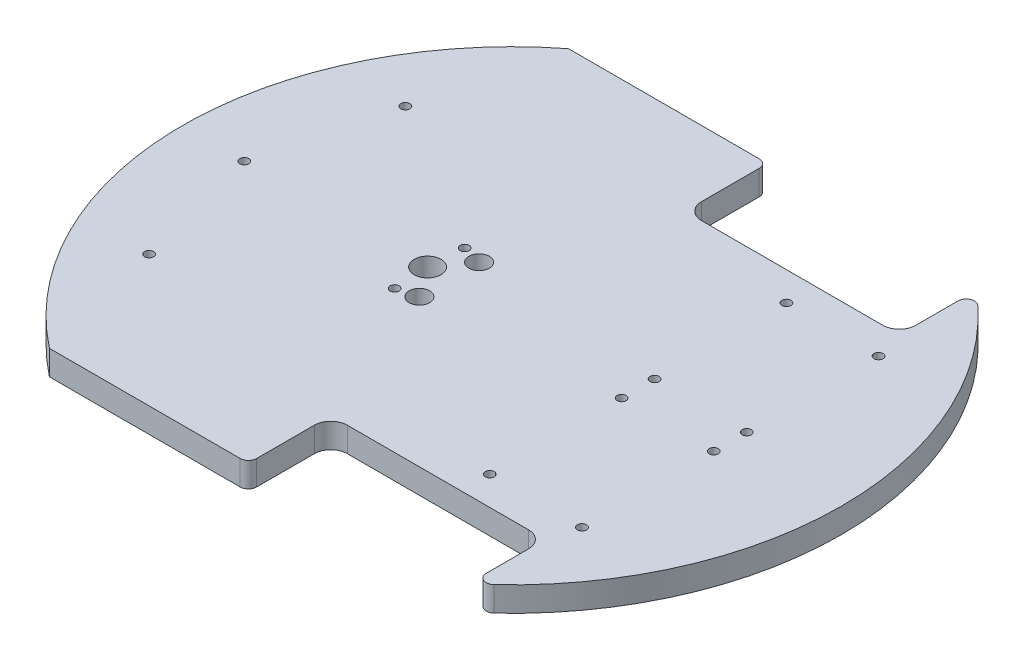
ISO-10303-21;
HEADER;
FILE_DESCRIPTION(('STEP AP214'),'2;1');
FILE_NAME('part.step','',(''),(''),'','','');
FILE_SCHEMA(('AUTOMOTIVE_DESIGN { 1 0 10303 214 1 1 1 1 }'));
ENDSEC;
DATA;
#1=APPLICATION_CONTEXT('core data for automotive mechanical design processes');
#2=APPLICATION_PROTOCOL_DEFINITION('international standard','automotive_design',2000,#1);
#3=PRODUCT_CONTEXT('',#1,'mechanical');
#4=PRODUCT('Part','Part','',(#3));
#5=PRODUCT_RELATED_PRODUCT_CATEGORY('part','',(#4));
#6=PRODUCT_DEFINITION_FORMATION('','',#4);
#7=PRODUCT_DEFINITION_CONTEXT('part definition',#1,'design');
#8=PRODUCT_DEFINITION('design','',#6,#7);
#9=PRODUCT_DEFINITION_SHAPE('','',#8);
#10=(LENGTH_UNIT() NAMED_UNIT(*) SI_UNIT(.MILLI.,.METRE.));
#11=(NAMED_UNIT(*) PLANE_ANGLE_UNIT() SI_UNIT($,.RADIAN.));
#12=(NAMED_UNIT(*) SI_UNIT($,.STERADIAN.) SOLID_ANGLE_UNIT());
#13=UNCERTAINTY_MEASURE_WITH_UNIT(LENGTH_MEASURE(1.E-05),#10,'distance_accuracy_value','');
#14=(GEOMETRIC_REPRESENTATION_CONTEXT(3) GLOBAL_UNCERTAINTY_ASSIGNED_CONTEXT((#13)) GLOBAL_UNIT_ASSIGNED_CONTEXT((#10,
#11,#12)) REPRESENTATION_CONTEXT('',''));
#15=CARTESIAN_POINT('',(0.,0.,0.));
#16=DIRECTION('',(0.,0.,1.));
#17=DIRECTION('',(1.,0.,0.));
#18=AXIS2_PLACEMENT_3D('',#15,#16,#17);
#19=CARTESIAN_POINT('',(-15.,6.,0.));
#20=DIRECTION('',(0.,1.,0.));
#21=DIRECTION('',(0.,0.,1.));
#22=AXIS2_PLACEMENT_3D('',#19,#20,#21);
#23=PLANE('',#22);
#24=CARTESIAN_POINT('',(-35.5,6.,0.));
#25=DIRECTION('',(0.,1.,0.));
#26=DIRECTION('',(0.,0.,1.));
#27=AXIS2_PLACEMENT_3D('',#24,#25,#26);
#28=CIRCLE('',#27,3.25);
#29=CARTESIAN_POINT('',(-35.5,6.,3.25));
#30=VERTEX_POINT('',#29);
#31=EDGE_CURVE('E465',#30,#30,#28,.T.);
#32=ORIENTED_EDGE('',*,*,#31,.F.);
#33=EDGE_LOOP('',(#32));
#34=FACE_BOUND('',#33,.T.);
#35=CARTESIAN_POINT('',(-72.,6.,-31.1));
#36=DIRECTION('',(0.,1.,0.));
#37=DIRECTION('',(0.,0.,1.));
#38=AXIS2_PLACEMENT_3D('',#35,#36,#37);
#39=CIRCLE('',#38,1.10000000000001);
#40=CARTESIAN_POINT('',(-72.,6.,-30.));
#41=VERTEX_POINT('',#40);
#42=EDGE_CURVE('E477',#41,#41,#39,.T.);
#43=ORIENTED_EDGE('',*,*,#42,.F.);
#44=EDGE_LOOP('',(#43));
#45=FACE_BOUND('',#44,.T.);
#46=CARTESIAN_POINT('',(-72.,6.,31.1));
#47=DIRECTION('',(0.,1.,0.));
#48=DIRECTION('',(0.,0.,-1.));
#49=AXIS2_PLACEMENT_3D('',#46,#47,#48);
#50=CIRCLE('',#49,1.10000000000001);
#51=CARTESIAN_POINT('',(-72.,6.,30.));
#52=VERTEX_POINT('',#51);
#53=EDGE_CURVE('E489',#52,#52,#50,.T.);
#54=ORIENTED_EDGE('',*,*,#53,.F.);
#55=EDGE_LOOP('',(#54));
#56=FACE_BOUND('',#55,.T.);
#57=CARTESIAN_POINT('',(-35.,6.,8.5));
#58=DIRECTION('',(0.,1.,0.));
#59=DIRECTION('',(0.,0.,-1.));
#60=AXIS2_PLACEMENT_3D('',#57,#58,#59);
#61=CIRCLE('',#60,1.1);
#62=CARTESIAN_POINT('',(-35.,6.,7.4));
#63=VERTEX_POINT('',#62);
#64=EDGE_CURVE('E501',#63,#63,#61,.T.);
#65=ORIENTED_EDGE('',*,*,#64,.F.);
#66=EDGE_LOOP('',(#65));
#67=FACE_BOUND('',#66,.T.);
#68=CARTESIAN_POINT('',(15.6,6.,-36.));
#69=DIRECTION('',(0.,1.,0.));
#70=DIRECTION('',(0.,0.,1.));
#71=AXIS2_PLACEMENT_3D('',#68,#69,#70);
#72=CIRCLE('',#71,1.09999999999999);
#73=CARTESIAN_POINT('',(15.6,6.,-34.9));
#74=VERTEX_POINT('',#73);
#75=EDGE_CURVE('E513',#74,#74,#72,.T.);
#76=ORIENTED_EDGE('',*,*,#75,.F.);
#77=EDGE_LOOP('',(#76));
#78=FACE_BOUND('',#77,.T.);
#79=CARTESIAN_POINT('',(15.6,6.,36.));
#80=DIRECTION('',(0.,1.,0.));
#81=DIRECTION('',(0.,0.,-1.));
#82=AXIS2_PLACEMENT_3D('',#79,#80,#81);
#83=CIRCLE('',#82,1.09999999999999);
#84=CARTESIAN_POINT('',(15.6,6.,34.9));
#85=VERTEX_POINT('',#84);
#86=EDGE_CURVE('E525',#85,#85,#83,.T.);
#87=ORIENTED_EDGE('',*,*,#86,.F.);
#88=EDGE_LOOP('',(#87));
#89=FACE_BOUND('',#88,.T.);
#90=CARTESIAN_POINT('',(37.9590359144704,6.,4.));
#91=DIRECTION('',(0.,1.,0.));
#92=DIRECTION('',(0.,0.,1.));
#93=AXIS2_PLACEMENT_3D('',#90,#91,#92);
#94=CIRCLE('',#93,1.1);
#95=CARTESIAN_POINT('',(37.9590359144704,6.,5.1));
#96=VERTEX_POINT('',#95);
#97=EDGE_CURVE('E537',#96,#96,#94,.T.);
#98=ORIENTED_EDGE('',*,*,#97,.F.);
#99=EDGE_LOOP('',(#98));
#100=FACE_BOUND('',#99,.T.);
#101=CARTESIAN_POINT('',(37.9590359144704,6.,-4.));
#102=DIRECTION('',(0.,1.,0.));
#103=DIRECTION('',(0.,0.,-1.));
#104=AXIS2_PLACEMENT_3D('',#101,#102,#103);
#105=CIRCLE('',#104,1.1);
#106=CARTESIAN_POINT('',(37.9590359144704,6.,-5.1));
#107=VERTEX_POINT('',#106);
#108=EDGE_CURVE('E179',#107,#107,#105,.T.);
#109=ORIENTED_EDGE('',*,*,#108,.F.);
#110=EDGE_LOOP('',(#109));
#111=FACE_BOUND('',#110,.T.);
#112=CARTESIAN_POINT('',(-15.,6.,0.));
#113=DIRECTION('',(0.,1.,0.));
#114=DIRECTION('',(0.,0.,1.));
#115=AXIS2_PLACEMENT_3D('',#112,#113,#114);
#116=CIRCLE('',#115,80.0000000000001);
#117=CARTESIAN_POINT('',(-64.3051721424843,6.,-63.0000000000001));
#118=VERTEX_POINT('',#117);
#119=CARTESIAN_POINT('',(-64.3051721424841,6.,63.));
#120=VERTEX_POINT('',#119);
#121=EDGE_CURVE('E217',#118,#120,#116,.T.);
#122=ORIENTED_EDGE('',*,*,#121,.T.);
#123=DIRECTION('',(1.,0.,0.));
#124=VECTOR('',#123,1.);
#125=CARTESIAN_POINT('',(-64.3051721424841,6.,63.));
#126=LINE('',#125,#124);
#127=CARTESIAN_POINT('',(-18.,6.,63.));
#128=VERTEX_POINT('',#127);
#129=EDGE_CURVE('E174',#120,#128,#126,.T.);
#130=ORIENTED_EDGE('',*,*,#129,.T.);
#131=CARTESIAN_POINT('',(-18.,6.,61.));
#132=DIRECTION('',(0.,1.,0.));
#133=DIRECTION('',(0.,0.,1.));
#134=AXIS2_PLACEMENT_3D('',#131,#132,#133);
#135=CIRCLE('',#134,2.00000000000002);
#136=CARTESIAN_POINT('',(-16.,6.,61.));
#137=VERTEX_POINT('',#136);
#138=EDGE_CURVE('E220',#128,#137,#135,.T.);
#139=ORIENTED_EDGE('',*,*,#138,.T.);
#140=DIRECTION('',(0.,0.,-1.));
#141=VECTOR('',#140,1.);
#142=CARTESIAN_POINT('',(-16.,6.,61.));
#143=LINE('',#142,#141);
#144=CARTESIAN_POINT('',(-16.,6.,47.));
#145=VERTEX_POINT('',#144);
#146=EDGE_CURVE('E222',#137,#145,#143,.T.);
#147=ORIENTED_EDGE('',*,*,#146,.T.);
#148=CARTESIAN_POINT('',(-12.,6.,47.));
#149=DIRECTION('',(0.,-1.,0.));
#150=DIRECTION('',(0.,0.,-1.));
#151=AXIS2_PLACEMENT_3D('',#148,#149,#150);
#152=CIRCLE('',#151,3.99999999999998);
#153=CARTESIAN_POINT('',(-12.,6.,43.));
#154=VERTEX_POINT('',#153);
#155=EDGE_CURVE('E224',#145,#154,#152,.T.);
#156=ORIENTED_EDGE('',*,*,#155,.T.);
#157=DIRECTION('',(1.,0.,0.));
#158=VECTOR('',#157,1.);
#159=CARTESIAN_POINT('',(-12.,6.,43.));
#160=LINE('',#159,#158);
#161=CARTESIAN_POINT('',(32.,6.,43.));
#162=VERTEX_POINT('',#161);
#163=EDGE_CURVE('E226',#154,#162,#160,.T.);
#164=ORIENTED_EDGE('',*,*,#163,.T.);
#165=CARTESIAN_POINT('',(32.,6.,47.));
#166=DIRECTION('',(0.,-1.,0.));
#167=DIRECTION('',(0.,0.,-1.));
#168=AXIS2_PLACEMENT_3D('',#165,#166,#167);
#169=CIRCLE('',#168,4.00000000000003);
#170=CARTESIAN_POINT('',(36.,6.,47.));
#171=VERTEX_POINT('',#170);
#172=EDGE_CURVE('E228',#162,#171,#169,.T.);
#173=ORIENTED_EDGE('',*,*,#172,.T.);
#174=DIRECTION('',(0.,0.,1.));
#175=VECTOR('',#174,1.);
#176=CARTESIAN_POINT('',(36.,6.,57.227615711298));
#177=LINE('',#176,#175);
#178=CARTESIAN_POINT('',(36.,6.,57.227615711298));
#179=VERTEX_POINT('',#178);
#180=EDGE_CURVE('E230',#171,#179,#177,.T.);
#181=ORIENTED_EDGE('',*,*,#180,.T.);
#182=CARTESIAN_POINT('',(38.,6.,57.227615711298));
#183=DIRECTION('',(0.,1.,0.));
#184=DIRECTION('',(0.,0.,1.));
#185=AXIS2_PLACEMENT_3D('',#182,#183,#184);
#186=CIRCLE('',#185,1.99999999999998);
#187=CARTESIAN_POINT('',(39.3589743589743,6.,58.6949904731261));
#188=VERTEX_POINT('',#187);
#189=EDGE_CURVE('E232',#179,#188,#186,.T.);
#190=ORIENTED_EDGE('',*,*,#189,.T.);
#191=CARTESIAN_POINT('',(-15.,6.,0.));
#192=DIRECTION('',(0.,1.,0.));
#193=DIRECTION('',(0.,0.,1.));
#194=AXIS2_PLACEMENT_3D('',#191,#192,#193);
#195=CIRCLE('',#194,80.);
#196=CARTESIAN_POINT('',(39.3589743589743,6.,-58.6949904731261));
#197=VERTEX_POINT('',#196);
#198=EDGE_CURVE('E234',#188,#197,#195,.T.);
#199=ORIENTED_EDGE('',*,*,#198,.T.);
#200=CARTESIAN_POINT('',(38.,6.,-57.227615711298));
#201=DIRECTION('',(0.,1.,0.));
#202=DIRECTION('',(0.,0.,1.));
#203=AXIS2_PLACEMENT_3D('',#200,#201,#202);
#204=CIRCLE('',#203,1.99999999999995);
#205=CARTESIAN_POINT('',(36.,6.,-57.2276157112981));
#206=VERTEX_POINT('',#205);
#207=EDGE_CURVE('E236',#197,#206,#204,.T.);
#208=ORIENTED_EDGE('',*,*,#207,.T.);
#209=DIRECTION('',(0.,0.,1.));
#210=VECTOR('',#209,1.);
#211=CARTESIAN_POINT('',(36.0000000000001,6.,-57.2276157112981));
#212=LINE('',#211,#210);
#213=CARTESIAN_POINT('',(36.0000000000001,6.,-47.));
#214=VERTEX_POINT('',#213);
#215=EDGE_CURVE('E238',#206,#214,#212,.T.);
#216=ORIENTED_EDGE('',*,*,#215,.T.);
#217=CARTESIAN_POINT('',(32.,6.,-47.));
#218=DIRECTION('',(0.,-1.,0.));
#219=DIRECTION('',(0.,0.,-1.));
#220=AXIS2_PLACEMENT_3D('',#217,#218,#219);
#221=CIRCLE('',#220,4.00000000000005);
#222=CARTESIAN_POINT('',(32.0000000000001,6.,-43.));
#223=VERTEX_POINT('',#222);
#224=EDGE_CURVE('E240',#214,#223,#221,.T.);
#225=ORIENTED_EDGE('',*,*,#224,.T.);
#226=DIRECTION('',(-1.,0.,0.));
#227=VECTOR('',#226,1.);
#228=CARTESIAN_POINT('',(-12.,6.,-43.));
#229=LINE('',#228,#227);
#230=CARTESIAN_POINT('',(-12.,6.,-43.));
#231=VERTEX_POINT('',#230);
#232=EDGE_CURVE('E242',#223,#231,#229,.T.);
#233=ORIENTED_EDGE('',*,*,#232,.T.);
#234=CARTESIAN_POINT('',(-12.,6.,-47.));
#235=DIRECTION('',(0.,-1.,0.));
#236=DIRECTION('',(0.,0.,-1.));
#237=AXIS2_PLACEMENT_3D('',#234,#235,#236);
#238=CIRCLE('',#237,4.);
#239=CARTESIAN_POINT('',(-16.,6.,-47.));
#240=VERTEX_POINT('',#239);
#241=EDGE_CURVE('E244',#231,#240,#238,.T.);
#242=ORIENTED_EDGE('',*,*,#241,.T.);
#243=DIRECTION('',(0.,0.,-1.));
#244=VECTOR('',#243,1.);
#245=CARTESIAN_POINT('',(-16.,6.,-61.));
#246=LINE('',#245,#244);
#247=CARTESIAN_POINT('',(-16.,6.,-61.));
#248=VERTEX_POINT('',#247);
#249=EDGE_CURVE('E246',#240,#248,#246,.T.);
#250=ORIENTED_EDGE('',*,*,#249,.T.);
#251=CARTESIAN_POINT('',(-18.,6.,-61.));
#252=DIRECTION('',(0.,1.,0.));
#253=DIRECTION('',(0.,0.,1.));
#254=AXIS2_PLACEMENT_3D('',#251,#252,#253);
#255=CIRCLE('',#254,2.00000000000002);
#256=CARTESIAN_POINT('',(-18.,6.,-63.));
#257=VERTEX_POINT('',#256);
#258=EDGE_CURVE('E55',#248,#257,#255,.T.);
#259=ORIENTED_EDGE('',*,*,#258,.T.);
#260=DIRECTION('',(-1.,0.,0.));
#261=VECTOR('',#260,1.);
#262=CARTESIAN_POINT('',(-64.3051721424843,6.,-63.0000000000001));
#263=LINE('',#262,#261);
#264=EDGE_CURVE('E50',#257,#118,#263,.T.);
#265=ORIENTED_EDGE('',*,*,#264,.T.);
#266=EDGE_LOOP('',(#122,#130,#139,#147,#156,#164,#173,#181,#190,#199,#208,#216,#225,#233,#242,
#250,#259,#265));
#267=FACE_BOUND('',#266,.T.);
#268=CARTESIAN_POINT('',(15.6,6.,4.));
#269=DIRECTION('',(0.,1.,0.));
#270=DIRECTION('',(0.,0.,1.));
#271=AXIS2_PLACEMENT_3D('',#268,#269,#270);
#272=CIRCLE('',#271,1.1);
#273=CARTESIAN_POINT('',(15.6,6.,5.1));
#274=VERTEX_POINT('',#273);
#275=EDGE_CURVE('E543',#274,#274,#272,.T.);
#276=ORIENTED_EDGE('',*,*,#275,.F.);
#277=EDGE_LOOP('',(#276));
#278=FACE_BOUND('',#277,.T.);
#279=CARTESIAN_POINT('',(37.9590359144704,6.,36.));
#280=DIRECTION('',(0.,1.,0.));
#281=DIRECTION('',(0.,0.,-1.));
#282=AXIS2_PLACEMENT_3D('',#279,#280,#281);
#283=CIRCLE('',#282,1.1);
#284=CARTESIAN_POINT('',(37.9590359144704,6.,34.9));
#285=VERTEX_POINT('',#284);
#286=EDGE_CURVE('E531',#285,#285,#283,.T.);
#287=ORIENTED_EDGE('',*,*,#286,.F.);
#288=EDGE_LOOP('',(#287));
#289=FACE_BOUND('',#288,.T.);
#290=CARTESIAN_POINT('',(37.9590359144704,6.,-36.));
#291=DIRECTION('',(0.,1.,0.));
#292=DIRECTION('',(0.,0.,1.));
#293=AXIS2_PLACEMENT_3D('',#290,#291,#292);
#294=CIRCLE('',#293,1.1);
#295=CARTESIAN_POINT('',(37.9590359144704,6.,-34.9));
#296=VERTEX_POINT('',#295);
#297=EDGE_CURVE('E519',#296,#296,#294,.T.);
#298=ORIENTED_EDGE('',*,*,#297,.F.);
#299=EDGE_LOOP('',(#298));
#300=FACE_BOUND('',#299,.T.);
#301=CARTESIAN_POINT('',(15.6,6.,-4.));
#302=DIRECTION('',(0.,1.,0.));
#303=DIRECTION('',(0.,0.,-1.));
#304=AXIS2_PLACEMENT_3D('',#301,#302,#303);
#305=CIRCLE('',#304,1.1);
#306=CARTESIAN_POINT('',(15.6,6.,-5.1));
#307=VERTEX_POINT('',#306);
#308=EDGE_CURVE('E507',#307,#307,#305,.T.);
#309=ORIENTED_EDGE('',*,*,#308,.F.);
#310=EDGE_LOOP('',(#309));
#311=FACE_BOUND('',#310,.T.);
#312=CARTESIAN_POINT('',(-30.25,6.,-7.25));
#313=DIRECTION('',(0.,1.,0.));
#314=DIRECTION('',(0.,0.,-1.));
#315=AXIS2_PLACEMENT_3D('',#312,#313,#314);
#316=CIRCLE('',#315,2.5);
#317=CARTESIAN_POINT('',(-30.25,6.,-9.75));
#318=VERTEX_POINT('',#317);
#319=EDGE_CURVE('E495',#318,#318,#316,.T.);
#320=ORIENTED_EDGE('',*,*,#319,.F.);
#321=EDGE_LOOP('',(#320));
#322=FACE_BOUND('',#321,.T.);
#323=CARTESIAN_POINT('',(-80.,6.,0.));
#324=DIRECTION('',(0.,1.,0.));
#325=DIRECTION('',(0.,0.,1.));
#326=AXIS2_PLACEMENT_3D('',#323,#324,#325);
#327=CIRCLE('',#326,1.10000000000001);
#328=CARTESIAN_POINT('',(-80.,6.,1.10000000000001));
#329=VERTEX_POINT('',#328);
#330=EDGE_CURVE('E483',#329,#329,#327,.T.);
#331=ORIENTED_EDGE('',*,*,#330,.F.);
#332=EDGE_LOOP('',(#331));
#333=FACE_BOUND('',#332,.T.);
#334=CARTESIAN_POINT('',(-35.,6.,-8.5));
#335=DIRECTION('',(0.,1.,0.));
#336=DIRECTION('',(0.,0.,1.));
#337=AXIS2_PLACEMENT_3D('',#334,#335,#336);
#338=CIRCLE('',#337,1.1);
#339=CARTESIAN_POINT('',(-35.,6.,-7.4));
#340=VERTEX_POINT('',#339);
#341=EDGE_CURVE('E471',#340,#340,#338,.T.);
#342=ORIENTED_EDGE('',*,*,#341,.F.);
#343=EDGE_LOOP('',(#342));
#344=FACE_BOUND('',#343,.T.);
#345=CARTESIAN_POINT('',(-30.25,6.,7.25));
#346=DIRECTION('',(0.,1.,0.));
#347=DIRECTION('',(0.,0.,1.));
#348=AXIS2_PLACEMENT_3D('',#345,#346,#347);
#349=CIRCLE('',#348,2.5);
#350=CARTESIAN_POINT('',(-30.25,6.,9.75));
#351=VERTEX_POINT('',#350);
#352=EDGE_CURVE('E454',#351,#351,#349,.T.);
#353=ORIENTED_EDGE('',*,*,#352,.F.);
#354=EDGE_LOOP('',(#353));
#355=FACE_BOUND('',#354,.T.);
#356=ADVANCED_FACE('F35',(#34,#45,#56,#67,#78,#89,#100,#111,#267,#278,#289,#300,#311,#322,#333,
#344,#355),#23,.T.);
#357=CARTESIAN_POINT('',(-15.,0.,0.));
#358=DIRECTION('',(0.,1.,0.));
#359=DIRECTION('',(0.,0.,1.));
#360=AXIS2_PLACEMENT_3D('',#357,#358,#359);
#361=PLANE('',#360);
#362=CARTESIAN_POINT('',(-35.5,0.,0.));
#363=DIRECTION('',(0.,1.,0.));
#364=DIRECTION('',(0.,0.,1.));
#365=AXIS2_PLACEMENT_3D('',#362,#363,#364);
#366=CIRCLE('',#365,3.25);
#367=CARTESIAN_POINT('',(-35.5,0.,3.25));
#368=VERTEX_POINT('',#367);
#369=EDGE_CURVE('E460',#368,#368,#366,.T.);
#370=ORIENTED_EDGE('',*,*,#369,.T.);
#371=EDGE_LOOP('',(#370));
#372=FACE_BOUND('',#371,.T.);
#373=CARTESIAN_POINT('',(-72.,0.,-31.1));
#374=DIRECTION('',(0.,1.,0.));
#375=DIRECTION('',(0.,0.,1.));
#376=AXIS2_PLACEMENT_3D('',#373,#374,#375);
#377=CIRCLE('',#376,1.10000000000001);
#378=CARTESIAN_POINT('',(-72.,0.,-30.));
#379=VERTEX_POINT('',#378);
#380=EDGE_CURVE('E474',#379,#379,#377,.T.);
#381=ORIENTED_EDGE('',*,*,#380,.T.);
#382=EDGE_LOOP('',(#381));
#383=FACE_BOUND('',#382,.T.);
#384=CARTESIAN_POINT('',(-72.,0.,31.1));
#385=DIRECTION('',(0.,1.,0.));
#386=DIRECTION('',(0.,0.,-1.));
#387=AXIS2_PLACEMENT_3D('',#384,#385,#386);
#388=CIRCLE('',#387,1.10000000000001);
#389=CARTESIAN_POINT('',(-72.,0.,30.));
#390=VERTEX_POINT('',#389);
#391=EDGE_CURVE('E486',#390,#390,#388,.T.);
#392=ORIENTED_EDGE('',*,*,#391,.T.);
#393=EDGE_LOOP('',(#392));
#394=FACE_BOUND('',#393,.T.);
#395=CARTESIAN_POINT('',(-35.,0.,8.5));
#396=DIRECTION('',(0.,1.,0.));
#397=DIRECTION('',(0.,0.,-1.));
#398=AXIS2_PLACEMENT_3D('',#395,#396,#397);
#399=CIRCLE('',#398,1.1);
#400=CARTESIAN_POINT('',(-35.,0.,7.4));
#401=VERTEX_POINT('',#400);
#402=EDGE_CURVE('E498',#401,#401,#399,.T.);
#403=ORIENTED_EDGE('',*,*,#402,.T.);
#404=EDGE_LOOP('',(#403));
#405=FACE_BOUND('',#404,.T.);
#406=CARTESIAN_POINT('',(15.6,0.,-36.));
#407=DIRECTION('',(0.,1.,0.));
#408=DIRECTION('',(0.,0.,1.));
#409=AXIS2_PLACEMENT_3D('',#406,#407,#408);
#410=CIRCLE('',#409,1.09999999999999);
#411=CARTESIAN_POINT('',(15.6,0.,-34.9));
#412=VERTEX_POINT('',#411);
#413=EDGE_CURVE('E510',#412,#412,#410,.T.);
#414=ORIENTED_EDGE('',*,*,#413,.T.);
#415=EDGE_LOOP('',(#414));
#416=FACE_BOUND('',#415,.T.);
#417=CARTESIAN_POINT('',(15.6,0.,36.));
#418=DIRECTION('',(0.,1.,0.));
#419=DIRECTION('',(0.,0.,-1.));
#420=AXIS2_PLACEMENT_3D('',#417,#418,#419);
#421=CIRCLE('',#420,1.09999999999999);
#422=CARTESIAN_POINT('',(15.6,0.,34.9));
#423=VERTEX_POINT('',#422);
#424=EDGE_CURVE('E522',#423,#423,#421,.T.);
#425=ORIENTED_EDGE('',*,*,#424,.T.);
#426=EDGE_LOOP('',(#425));
#427=FACE_BOUND('',#426,.T.);
#428=CARTESIAN_POINT('',(37.9590359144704,0.,4.));
#429=DIRECTION('',(0.,1.,0.));
#430=DIRECTION('',(0.,0.,1.));
#431=AXIS2_PLACEMENT_3D('',#428,#429,#430);
#432=CIRCLE('',#431,1.1);
#433=CARTESIAN_POINT('',(37.9590359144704,0.,5.1));
#434=VERTEX_POINT('',#433);
#435=EDGE_CURVE('E534',#434,#434,#432,.T.);
#436=ORIENTED_EDGE('',*,*,#435,.T.);
#437=EDGE_LOOP('',(#436));
#438=FACE_BOUND('',#437,.T.);
#439=CARTESIAN_POINT('',(37.9590359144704,0.,-4.));
#440=DIRECTION('',(0.,1.,0.));
#441=DIRECTION('',(0.,0.,-1.));
#442=AXIS2_PLACEMENT_3D('',#439,#440,#441);
#443=CIRCLE('',#442,1.1);
#444=CARTESIAN_POINT('',(37.9590359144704,0.,-5.1));
#445=VERTEX_POINT('',#444);
#446=EDGE_CURVE('E182',#445,#445,#443,.T.);
#447=ORIENTED_EDGE('',*,*,#446,.T.);
#448=EDGE_LOOP('',(#447));
#449=FACE_BOUND('',#448,.T.);
#450=CARTESIAN_POINT('',(-15.,0.,0.));
#451=DIRECTION('',(0.,1.,0.));
#452=DIRECTION('',(0.,0.,1.));
#453=AXIS2_PLACEMENT_3D('',#450,#451,#452);
#454=CIRCLE('',#453,80.0000000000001);
#455=CARTESIAN_POINT('',(-64.3051721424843,0.,-63.0000000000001));
#456=VERTEX_POINT('',#455);
#457=CARTESIAN_POINT('',(-64.3051721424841,0.,63.));
#458=VERTEX_POINT('',#457);
#459=EDGE_CURVE('E165',#456,#458,#454,.T.);
#460=ORIENTED_EDGE('',*,*,#459,.F.);
#461=DIRECTION('',(-1.,0.,0.));
#462=VECTOR('',#461,1.);
#463=CARTESIAN_POINT('',(-64.3051721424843,0.,-63.0000000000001));
#464=LINE('',#463,#462);
#465=CARTESIAN_POINT('',(-18.,0.,-63.));
#466=VERTEX_POINT('',#465);
#467=EDGE_CURVE('E215',#466,#456,#464,.T.);
#468=ORIENTED_EDGE('',*,*,#467,.F.);
#469=CARTESIAN_POINT('',(-18.,0.,-61.));
#470=DIRECTION('',(0.,1.,0.));
#471=DIRECTION('',(0.,0.,1.));
#472=AXIS2_PLACEMENT_3D('',#469,#470,#471);
#473=CIRCLE('',#472,2.00000000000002);
#474=CARTESIAN_POINT('',(-16.,0.,-61.));
#475=VERTEX_POINT('',#474);
#476=EDGE_CURVE('E213',#475,#466,#473,.T.);
#477=ORIENTED_EDGE('',*,*,#476,.F.);
#478=DIRECTION('',(0.,0.,-1.));
#479=VECTOR('',#478,1.);
#480=CARTESIAN_POINT('',(-16.,0.,-61.));
#481=LINE('',#480,#479);
#482=CARTESIAN_POINT('',(-16.,0.,-47.));
#483=VERTEX_POINT('',#482);
#484=EDGE_CURVE('E211',#483,#475,#481,.T.);
#485=ORIENTED_EDGE('',*,*,#484,.F.);
#486=CARTESIAN_POINT('',(-12.,0.,-47.));
#487=DIRECTION('',(0.,-1.,0.));
#488=DIRECTION('',(0.,0.,-1.));
#489=AXIS2_PLACEMENT_3D('',#486,#487,#488);
#490=CIRCLE('',#489,4.);
#491=CARTESIAN_POINT('',(-12.,0.,-43.));
#492=VERTEX_POINT('',#491);
#493=EDGE_CURVE('E209',#492,#483,#490,.T.);
#494=ORIENTED_EDGE('',*,*,#493,.F.);
#495=DIRECTION('',(-1.,0.,0.));
#496=VECTOR('',#495,1.);
#497=CARTESIAN_POINT('',(-12.,0.,-43.));
#498=LINE('',#497,#496);
#499=CARTESIAN_POINT('',(32.0000000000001,0.,-43.));
#500=VERTEX_POINT('',#499);
#501=EDGE_CURVE('E207',#500,#492,#498,.T.);
#502=ORIENTED_EDGE('',*,*,#501,.F.);
#503=CARTESIAN_POINT('',(32.,0.,-47.));
#504=DIRECTION('',(0.,-1.,0.));
#505=DIRECTION('',(0.,0.,-1.));
#506=AXIS2_PLACEMENT_3D('',#503,#504,#505);
#507=CIRCLE('',#506,4.00000000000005);
#508=CARTESIAN_POINT('',(36.0000000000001,0.,-47.));
#509=VERTEX_POINT('',#508);
#510=EDGE_CURVE('E205',#509,#500,#507,.T.);
#511=ORIENTED_EDGE('',*,*,#510,.F.);
#512=DIRECTION('',(0.,0.,1.));
#513=VECTOR('',#512,1.);
#514=CARTESIAN_POINT('',(36.0000000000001,0.,-57.2276157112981));
#515=LINE('',#514,#513);
#516=CARTESIAN_POINT('',(36.,0.,-57.2276157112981));
#517=VERTEX_POINT('',#516);
#518=EDGE_CURVE('E203',#517,#509,#515,.T.);
#519=ORIENTED_EDGE('',*,*,#518,.F.);
#520=CARTESIAN_POINT('',(38.,0.,-57.227615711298));
#521=DIRECTION('',(0.,1.,0.));
#522=DIRECTION('',(0.,0.,1.));
#523=AXIS2_PLACEMENT_3D('',#520,#521,#522);
#524=CIRCLE('',#523,1.99999999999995);
#525=CARTESIAN_POINT('',(39.3589743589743,0.,-58.6949904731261));
#526=VERTEX_POINT('',#525);
#527=EDGE_CURVE('E201',#526,#517,#524,.T.);
#528=ORIENTED_EDGE('',*,*,#527,.F.);
#529=CARTESIAN_POINT('',(-15.,0.,0.));
#530=DIRECTION('',(0.,1.,0.));
#531=DIRECTION('',(0.,0.,1.));
#532=AXIS2_PLACEMENT_3D('',#529,#530,#531);
#533=CIRCLE('',#532,80.);
#534=CARTESIAN_POINT('',(39.3589743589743,0.,58.6949904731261));
#535=VERTEX_POINT('',#534);
#536=EDGE_CURVE('E199',#535,#526,#533,.T.);
#537=ORIENTED_EDGE('',*,*,#536,.F.);
#538=CARTESIAN_POINT('',(38.,0.,57.227615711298));
#539=DIRECTION('',(0.,1.,0.));
#540=DIRECTION('',(0.,0.,1.));
#541=AXIS2_PLACEMENT_3D('',#538,#539,#540);
#542=CIRCLE('',#541,1.99999999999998);
#543=CARTESIAN_POINT('',(36.,0.,57.227615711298));
#544=VERTEX_POINT('',#543);
#545=EDGE_CURVE('E197',#544,#535,#542,.T.);
#546=ORIENTED_EDGE('',*,*,#545,.F.);
#547=DIRECTION('',(0.,0.,1.));
#548=VECTOR('',#547,1.);
#549=CARTESIAN_POINT('',(36.,0.,57.227615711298));
#550=LINE('',#549,#548);
#551=CARTESIAN_POINT('',(36.,0.,47.));
#552=VERTEX_POINT('',#551);
#553=EDGE_CURVE('E195',#552,#544,#550,.T.);
#554=ORIENTED_EDGE('',*,*,#553,.F.);
#555=CARTESIAN_POINT('',(32.,0.,47.));
#556=DIRECTION('',(0.,-1.,0.));
#557=DIRECTION('',(0.,0.,-1.));
#558=AXIS2_PLACEMENT_3D('',#555,#556,#557);
#559=CIRCLE('',#558,4.00000000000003);
#560=CARTESIAN_POINT('',(32.,0.,43.));
#561=VERTEX_POINT('',#560);
#562=EDGE_CURVE('E193',#561,#552,#559,.T.);
#563=ORIENTED_EDGE('',*,*,#562,.F.);
#564=DIRECTION('',(1.,0.,0.));
#565=VECTOR('',#564,1.);
#566=CARTESIAN_POINT('',(-12.,0.,43.));
#567=LINE('',#566,#565);
#568=CARTESIAN_POINT('',(-12.,0.,43.));
#569=VERTEX_POINT('',#568);
#570=EDGE_CURVE('E191',#569,#561,#567,.T.);
#571=ORIENTED_EDGE('',*,*,#570,.F.);
#572=CARTESIAN_POINT('',(-12.,0.,47.));
#573=DIRECTION('',(0.,-1.,0.));
#574=DIRECTION('',(0.,0.,-1.));
#575=AXIS2_PLACEMENT_3D('',#572,#573,#574);
#576=CIRCLE('',#575,3.99999999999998);
#577=CARTESIAN_POINT('',(-16.,0.,47.));
#578=VERTEX_POINT('',#577);
#579=EDGE_CURVE('E189',#578,#569,#576,.T.);
#580=ORIENTED_EDGE('',*,*,#579,.F.);
#581=DIRECTION('',(0.,0.,-1.));
#582=VECTOR('',#581,1.);
#583=CARTESIAN_POINT('',(-16.,0.,61.));
#584=LINE('',#583,#582);
#585=CARTESIAN_POINT('',(-16.,0.,61.));
#586=VERTEX_POINT('',#585);
#587=EDGE_CURVE('E187',#586,#578,#584,.T.);
#588=ORIENTED_EDGE('',*,*,#587,.F.);
#589=CARTESIAN_POINT('',(-18.,0.,61.));
#590=DIRECTION('',(0.,1.,0.));
#591=DIRECTION('',(0.,0.,1.));
#592=AXIS2_PLACEMENT_3D('',#589,#590,#591);
#593=CIRCLE('',#592,2.00000000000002);
#594=CARTESIAN_POINT('',(-18.,0.,63.));
#595=VERTEX_POINT('',#594);
#596=EDGE_CURVE('E167',#595,#586,#593,.T.);
#597=ORIENTED_EDGE('',*,*,#596,.F.);
#598=DIRECTION('',(1.,0.,0.));
#599=VECTOR('',#598,1.);
#600=CARTESIAN_POINT('',(-64.3051721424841,0.,63.));
#601=LINE('',#600,#599);
#602=EDGE_CURVE('E160',#458,#595,#601,.T.);
#603=ORIENTED_EDGE('',*,*,#602,.F.);
#604=EDGE_LOOP('',(#460,#468,#477,#485,#494,#502,#511,#519,#528,#537,#546,#554,#563,#571,#580,
#588,#597,#603));
#605=FACE_BOUND('',#604,.T.);
#606=CARTESIAN_POINT('',(15.6,0.,4.));
#607=DIRECTION('',(0.,1.,0.));
#608=DIRECTION('',(0.,0.,1.));
#609=AXIS2_PLACEMENT_3D('',#606,#607,#608);
#610=CIRCLE('',#609,1.1);
#611=CARTESIAN_POINT('',(15.6,0.,5.1));
#612=VERTEX_POINT('',#611);
#613=EDGE_CURVE('E540',#612,#612,#610,.T.);
#614=ORIENTED_EDGE('',*,*,#613,.T.);
#615=EDGE_LOOP('',(#614));
#616=FACE_BOUND('',#615,.T.);
#617=CARTESIAN_POINT('',(37.9590359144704,0.,36.));
#618=DIRECTION('',(0.,1.,0.));
#619=DIRECTION('',(0.,0.,-1.));
#620=AXIS2_PLACEMENT_3D('',#617,#618,#619);
#621=CIRCLE('',#620,1.1);
#622=CARTESIAN_POINT('',(37.9590359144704,0.,34.9));
#623=VERTEX_POINT('',#622);
#624=EDGE_CURVE('E528',#623,#623,#621,.T.);
#625=ORIENTED_EDGE('',*,*,#624,.T.);
#626=EDGE_LOOP('',(#625));
#627=FACE_BOUND('',#626,.T.);
#628=CARTESIAN_POINT('',(37.9590359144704,0.,-36.));
#629=DIRECTION('',(0.,1.,0.));
#630=DIRECTION('',(0.,0.,1.));
#631=AXIS2_PLACEMENT_3D('',#628,#629,#630);
#632=CIRCLE('',#631,1.1);
#633=CARTESIAN_POINT('',(37.9590359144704,0.,-34.9));
#634=VERTEX_POINT('',#633);
#635=EDGE_CURVE('E516',#634,#634,#632,.T.);
#636=ORIENTED_EDGE('',*,*,#635,.T.);
#637=EDGE_LOOP('',(#636));
#638=FACE_BOUND('',#637,.T.);
#639=CARTESIAN_POINT('',(15.6,0.,-4.));
#640=DIRECTION('',(0.,1.,0.));
#641=DIRECTION('',(0.,0.,-1.));
#642=AXIS2_PLACEMENT_3D('',#639,#640,#641);
#643=CIRCLE('',#642,1.1);
#644=CARTESIAN_POINT('',(15.6,0.,-5.1));
#645=VERTEX_POINT('',#644);
#646=EDGE_CURVE('E504',#645,#645,#643,.T.);
#647=ORIENTED_EDGE('',*,*,#646,.T.);
#648=EDGE_LOOP('',(#647));
#649=FACE_BOUND('',#648,.T.);
#650=CARTESIAN_POINT('',(-30.25,0.,-7.25));
#651=DIRECTION('',(0.,1.,0.));
#652=DIRECTION('',(0.,0.,-1.));
#653=AXIS2_PLACEMENT_3D('',#650,#651,#652);
#654=CIRCLE('',#653,2.5);
#655=CARTESIAN_POINT('',(-30.25,0.,-9.75));
#656=VERTEX_POINT('',#655);
#657=EDGE_CURVE('E492',#656,#656,#654,.T.);
#658=ORIENTED_EDGE('',*,*,#657,.T.);
#659=EDGE_LOOP('',(#658));
#660=FACE_BOUND('',#659,.T.);
#661=CARTESIAN_POINT('',(-80.,0.,0.));
#662=DIRECTION('',(0.,1.,0.));
#663=DIRECTION('',(0.,0.,1.));
#664=AXIS2_PLACEMENT_3D('',#661,#662,#663);
#665=CIRCLE('',#664,1.10000000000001);
#666=CARTESIAN_POINT('',(-80.,0.,1.10000000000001));
#667=VERTEX_POINT('',#666);
#668=EDGE_CURVE('E480',#667,#667,#665,.T.);
#669=ORIENTED_EDGE('',*,*,#668,.T.);
#670=EDGE_LOOP('',(#669));
#671=FACE_BOUND('',#670,.T.);
#672=CARTESIAN_POINT('',(-35.,0.,-8.5));
#673=DIRECTION('',(0.,1.,0.));
#674=DIRECTION('',(0.,0.,1.));
#675=AXIS2_PLACEMENT_3D('',#672,#673,#674);
#676=CIRCLE('',#675,1.1);
#677=CARTESIAN_POINT('',(-35.,0.,-7.4));
#678=VERTEX_POINT('',#677);
#679=EDGE_CURVE('E468',#678,#678,#676,.T.);
#680=ORIENTED_EDGE('',*,*,#679,.T.);
#681=EDGE_LOOP('',(#680));
#682=FACE_BOUND('',#681,.T.);
#683=CARTESIAN_POINT('',(-30.25,0.,7.25));
#684=DIRECTION('',(0.,1.,0.));
#685=DIRECTION('',(0.,0.,1.));
#686=AXIS2_PLACEMENT_3D('',#683,#684,#685);
#687=CIRCLE('',#686,2.5);
#688=CARTESIAN_POINT('',(-30.25,0.,9.75));
#689=VERTEX_POINT('',#688);
#690=EDGE_CURVE('E457',#689,#689,#687,.T.);
#691=ORIENTED_EDGE('',*,*,#690,.T.);
#692=EDGE_LOOP('',(#691));
#693=FACE_BOUND('',#692,.T.);
#694=ADVANCED_FACE('F161',(#372,#383,#394,#405,#416,#427,#438,#449,#605,#616,#627,#638,#649,
#660,#671,#682,#693),#361,.F.);
#695=CARTESIAN_POINT('',(-15.,6.,0.));
#696=DIRECTION('',(0.,-1.,0.));
#697=DIRECTION('',(0.,0.,-1.));
#698=AXIS2_PLACEMENT_3D('',#695,#696,#697);
#699=CYLINDRICAL_SURFACE('',#698,80.0000000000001);
#700=ORIENTED_EDGE('',*,*,#459,.T.);
#701=DIRECTION('',(0.,-1.,0.));
#702=VECTOR('',#701,1.);
#703=CARTESIAN_POINT('',(-64.3051721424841,6.,63.));
#704=LINE('',#703,#702);
#705=EDGE_CURVE('E11',#120,#458,#704,.T.);
#706=ORIENTED_EDGE('',*,*,#705,.F.);
#707=ORIENTED_EDGE('',*,*,#121,.F.);
#708=DIRECTION('',(0.,-1.,0.));
#709=VECTOR('',#708,1.);
#710=CARTESIAN_POINT('',(-64.3051721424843,6.,-63.0000000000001));
#711=LINE('',#710,#709);
#712=EDGE_CURVE('E178',#118,#456,#711,.T.);
#713=ORIENTED_EDGE('',*,*,#712,.T.);
#714=EDGE_LOOP('',(#700,#706,#707,#713));
#715=FACE_BOUND('',#714,.T.);
#716=ADVANCED_FACE('F37',(#715),#699,.T.);
#717=CARTESIAN_POINT('',(-64.3051721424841,6.,63.));
#718=DIRECTION('',(0.,0.,-1.));
#719=DIRECTION('',(-1.,0.,0.));
#720=AXIS2_PLACEMENT_3D('',#717,#718,#719);
#721=PLANE('',#720);
#722=ORIENTED_EDGE('',*,*,#602,.T.);
#723=DIRECTION('',(0.,-1.,0.));
#724=VECTOR('',#723,1.);
#725=CARTESIAN_POINT('',(-18.,6.,63.));
#726=LINE('',#725,#724);
#727=EDGE_CURVE('E43',#128,#595,#726,.T.);
#728=ORIENTED_EDGE('',*,*,#727,.F.);
#729=ORIENTED_EDGE('',*,*,#129,.F.);
#730=ORIENTED_EDGE('',*,*,#705,.T.);
#731=EDGE_LOOP('',(#722,#728,#729,#730));
#732=FACE_BOUND('',#731,.T.);
#733=ADVANCED_FACE('F173',(#732),#721,.F.);
#734=CARTESIAN_POINT('',(-18.,6.,61.));
#735=DIRECTION('',(0.,-1.,0.));
#736=DIRECTION('',(0.,0.,-1.));
#737=AXIS2_PLACEMENT_3D('',#734,#735,#736);
#738=CYLINDRICAL_SURFACE('',#737,2.00000000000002);
#739=ORIENTED_EDGE('',*,*,#596,.T.);
#740=DIRECTION('',(0.,-1.,0.));
#741=VECTOR('',#740,1.);
#742=CARTESIAN_POINT('',(-16.,6.,61.));
#743=LINE('',#742,#741);
#744=EDGE_CURVE('E293',#137,#586,#743,.T.);
#745=ORIENTED_EDGE('',*,*,#744,.F.);
#746=ORIENTED_EDGE('',*,*,#138,.F.);
#747=ORIENTED_EDGE('',*,*,#727,.T.);
#748=EDGE_LOOP('',(#739,#745,#746,#747));
#749=FACE_BOUND('',#748,.T.);
#750=ADVANCED_FACE('F297',(#749),#738,.T.);
#751=CARTESIAN_POINT('',(-16.,6.,61.));
#752=DIRECTION('',(-1.,0.,0.));
#753=DIRECTION('',(0.,0.,1.));
#754=AXIS2_PLACEMENT_3D('',#751,#752,#753);
#755=PLANE('',#754);
#756=ORIENTED_EDGE('',*,*,#587,.T.);
#757=DIRECTION('',(0.,-1.,0.));
#758=VECTOR('',#757,1.);
#759=CARTESIAN_POINT('',(-16.,6.,47.));
#760=LINE('',#759,#758);
#761=EDGE_CURVE('E290',#145,#578,#760,.T.);
#762=ORIENTED_EDGE('',*,*,#761,.F.);
#763=ORIENTED_EDGE('',*,*,#146,.F.);
#764=ORIENTED_EDGE('',*,*,#744,.T.);
#765=EDGE_LOOP('',(#756,#762,#763,#764));
#766=FACE_BOUND('',#765,.T.);
#767=ADVANCED_FACE('F305',(#766),#755,.F.);
#768=CARTESIAN_POINT('',(-12.,6.,47.));
#769=DIRECTION('',(0.,-1.,0.));
#770=DIRECTION('',(0.,0.,-1.));
#771=AXIS2_PLACEMENT_3D('',#768,#769,#770);
#772=CYLINDRICAL_SURFACE('',#771,3.99999999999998);
#773=ORIENTED_EDGE('',*,*,#579,.T.);
#774=DIRECTION('',(0.,-1.,0.));
#775=VECTOR('',#774,1.);
#776=CARTESIAN_POINT('',(-12.,6.,43.));
#777=LINE('',#776,#775);
#778=EDGE_CURVE('E287',#154,#569,#777,.T.);
#779=ORIENTED_EDGE('',*,*,#778,.F.);
#780=ORIENTED_EDGE('',*,*,#155,.F.);
#781=ORIENTED_EDGE('',*,*,#761,.T.);
#782=EDGE_LOOP('',(#773,#779,#780,#781));
#783=FACE_BOUND('',#782,.T.);
#784=ADVANCED_FACE('F308',(#783),#772,.F.);
#785=CARTESIAN_POINT('',(-12.,6.,43.));
#786=DIRECTION('',(0.,0.,-1.));
#787=DIRECTION('',(-1.,0.,0.));
#788=AXIS2_PLACEMENT_3D('',#785,#786,#787);
#789=PLANE('',#788);
#790=ORIENTED_EDGE('',*,*,#570,.T.);
#791=DIRECTION('',(0.,-1.,0.));
#792=VECTOR('',#791,1.);
#793=CARTESIAN_POINT('',(32.,6.,43.));
#794=LINE('',#793,#792);
#795=EDGE_CURVE('E284',#162,#561,#794,.T.);
#796=ORIENTED_EDGE('',*,*,#795,.F.);
#797=ORIENTED_EDGE('',*,*,#163,.F.);
#798=ORIENTED_EDGE('',*,*,#778,.T.);
#799=EDGE_LOOP('',(#790,#796,#797,#798));
#800=FACE_BOUND('',#799,.T.);
#801=ADVANCED_FACE('F313',(#800),#789,.F.);
#802=CARTESIAN_POINT('',(32.,6.,47.));
#803=DIRECTION('',(0.,-1.,0.));
#804=DIRECTION('',(0.,0.,-1.));
#805=AXIS2_PLACEMENT_3D('',#802,#803,#804);
#806=CYLINDRICAL_SURFACE('',#805,4.00000000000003);
#807=ORIENTED_EDGE('',*,*,#562,.T.);
#808=DIRECTION('',(0.,-1.,0.));
#809=VECTOR('',#808,1.);
#810=CARTESIAN_POINT('',(36.,6.,47.));
#811=LINE('',#810,#809);
#812=EDGE_CURVE('E281',#171,#552,#811,.T.);
#813=ORIENTED_EDGE('',*,*,#812,.F.);
#814=ORIENTED_EDGE('',*,*,#172,.F.);
#815=ORIENTED_EDGE('',*,*,#795,.T.);
#816=EDGE_LOOP('',(#807,#813,#814,#815));
#817=FACE_BOUND('',#816,.T.);
#818=ADVANCED_FACE('F319',(#817),#806,.F.);
#819=CARTESIAN_POINT('',(36.,6.,57.227615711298));
#820=DIRECTION('',(1.,0.,0.));
#821=DIRECTION('',(0.,0.,-1.));
#822=AXIS2_PLACEMENT_3D('',#819,#820,#821);
#823=PLANE('',#822);
#824=ORIENTED_EDGE('',*,*,#553,.T.);
#825=DIRECTION('',(0.,-1.,0.));
#826=VECTOR('',#825,1.);
#827=CARTESIAN_POINT('',(36.,6.,57.227615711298));
#828=LINE('',#827,#826);
#829=EDGE_CURVE('E278',#179,#544,#828,.T.);
#830=ORIENTED_EDGE('',*,*,#829,.F.);
#831=ORIENTED_EDGE('',*,*,#180,.F.);
#832=ORIENTED_EDGE('',*,*,#812,.T.);
#833=EDGE_LOOP('',(#824,#830,#831,#832));
#834=FACE_BOUND('',#833,.T.);
#835=ADVANCED_FACE('F323',(#834),#823,.F.);
#836=CARTESIAN_POINT('',(38.,6.,57.227615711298));
#837=DIRECTION('',(0.,-1.,0.));
#838=DIRECTION('',(0.,0.,-1.));
#839=AXIS2_PLACEMENT_3D('',#836,#837,#838);
#840=CYLINDRICAL_SURFACE('',#839,1.99999999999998);
#841=ORIENTED_EDGE('',*,*,#545,.T.);
#842=DIRECTION('',(0.,-1.,0.));
#843=VECTOR('',#842,1.);
#844=CARTESIAN_POINT('',(39.3589743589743,6.,58.6949904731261));
#845=LINE('',#844,#843);
#846=EDGE_CURVE('E275',#188,#535,#845,.T.);
#847=ORIENTED_EDGE('',*,*,#846,.F.);
#848=ORIENTED_EDGE('',*,*,#189,.F.);
#849=ORIENTED_EDGE('',*,*,#829,.T.);
#850=EDGE_LOOP('',(#841,#847,#848,#849));
#851=FACE_BOUND('',#850,.T.);
#852=ADVANCED_FACE('F328',(#851),#840,.T.);
#853=CARTESIAN_POINT('',(-15.,6.,0.));
#854=DIRECTION('',(0.,-1.,0.));
#855=DIRECTION('',(0.,0.,-1.));
#856=AXIS2_PLACEMENT_3D('',#853,#854,#855);
#857=CYLINDRICAL_SURFACE('',#856,80.);
#858=ORIENTED_EDGE('',*,*,#536,.T.);
#859=DIRECTION('',(0.,-1.,0.));
#860=VECTOR('',#859,1.);
#861=CARTESIAN_POINT('',(39.3589743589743,6.,-58.6949904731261));
#862=LINE('',#861,#860);
#863=EDGE_CURVE('E272',#197,#526,#862,.T.);
#864=ORIENTED_EDGE('',*,*,#863,.F.);
#865=ORIENTED_EDGE('',*,*,#198,.F.);
#866=ORIENTED_EDGE('',*,*,#846,.T.);
#867=EDGE_LOOP('',(#858,#864,#865,#866));
#868=FACE_BOUND('',#867,.T.);
#869=ADVANCED_FACE('F334',(#868),#857,.T.);
#870=CARTESIAN_POINT('',(38.,6.,-57.227615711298));
#871=DIRECTION('',(0.,-1.,0.));
#872=DIRECTION('',(0.,0.,-1.));
#873=AXIS2_PLACEMENT_3D('',#870,#871,#872);
#874=CYLINDRICAL_SURFACE('',#873,1.99999999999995);
#875=ORIENTED_EDGE('',*,*,#527,.T.);
#876=DIRECTION('',(0.,-1.,0.));
#877=VECTOR('',#876,1.);
#878=CARTESIAN_POINT('',(36.,6.,-57.2276157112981));
#879=LINE('',#878,#877);
#880=EDGE_CURVE('E269',#206,#517,#879,.T.);
#881=ORIENTED_EDGE('',*,*,#880,.F.);
#882=ORIENTED_EDGE('',*,*,#207,.F.);
#883=ORIENTED_EDGE('',*,*,#863,.T.);
#884=EDGE_LOOP('',(#875,#881,#882,#883));
#885=FACE_BOUND('',#884,.T.);
#886=ADVANCED_FACE('F338',(#885),#874,.T.);
#887=CARTESIAN_POINT('',(36.0000000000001,6.,-57.2276157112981));
#888=DIRECTION('',(1.,0.,0.));
#889=DIRECTION('',(0.,0.,-1.));
#890=AXIS2_PLACEMENT_3D('',#887,#888,#889);
#891=PLANE('',#890);
#892=ORIENTED_EDGE('',*,*,#518,.T.);
#893=DIRECTION('',(0.,-1.,0.));
#894=VECTOR('',#893,1.);
#895=CARTESIAN_POINT('',(36.0000000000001,6.,-47.));
#896=LINE('',#895,#894);
#897=EDGE_CURVE('E266',#214,#509,#896,.T.);
#898=ORIENTED_EDGE('',*,*,#897,.F.);
#899=ORIENTED_EDGE('',*,*,#215,.F.);
#900=ORIENTED_EDGE('',*,*,#880,.T.);
#901=EDGE_LOOP('',(#892,#898,#899,#900));
#902=FACE_BOUND('',#901,.T.);
#903=ADVANCED_FACE('F343',(#902),#891,.F.);
#904=CARTESIAN_POINT('',(32.,6.,-47.));
#905=DIRECTION('',(0.,-1.,0.));
#906=DIRECTION('',(0.,0.,-1.));
#907=AXIS2_PLACEMENT_3D('',#904,#905,#906);
#908=CYLINDRICAL_SURFACE('',#907,4.00000000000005);
#909=ORIENTED_EDGE('',*,*,#510,.T.);
#910=DIRECTION('',(0.,-1.,0.));
#911=VECTOR('',#910,1.);
#912=CARTESIAN_POINT('',(32.0000000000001,6.,-43.));
#913=LINE('',#912,#911);
#914=EDGE_CURVE('E263',#223,#500,#913,.T.);
#915=ORIENTED_EDGE('',*,*,#914,.F.);
#916=ORIENTED_EDGE('',*,*,#224,.F.);
#917=ORIENTED_EDGE('',*,*,#897,.T.);
#918=EDGE_LOOP('',(#909,#915,#916,#917));
#919=FACE_BOUND('',#918,.T.);
#920=ADVANCED_FACE('F349',(#919),#908,.F.);
#921=CARTESIAN_POINT('',(-12.,6.,-43.));
#922=DIRECTION('',(0.,0.,1.));
#923=DIRECTION('',(1.,0.,0.));
#924=AXIS2_PLACEMENT_3D('',#921,#922,#923);
#925=PLANE('',#924);
#926=ORIENTED_EDGE('',*,*,#501,.T.);
#927=DIRECTION('',(0.,-1.,0.));
#928=VECTOR('',#927,1.);
#929=CARTESIAN_POINT('',(-12.,6.,-43.));
#930=LINE('',#929,#928);
#931=EDGE_CURVE('E260',#231,#492,#930,.T.);
#932=ORIENTED_EDGE('',*,*,#931,.F.);
#933=ORIENTED_EDGE('',*,*,#232,.F.);
#934=ORIENTED_EDGE('',*,*,#914,.T.);
#935=EDGE_LOOP('',(#926,#932,#933,#934));
#936=FACE_BOUND('',#935,.T.);
#937=ADVANCED_FACE('F353',(#936),#925,.F.);
#938=CARTESIAN_POINT('',(-12.,6.,-47.));
#939=DIRECTION('',(0.,-1.,0.));
#940=DIRECTION('',(0.,0.,-1.));
#941=AXIS2_PLACEMENT_3D('',#938,#939,#940);
#942=CYLINDRICAL_SURFACE('',#941,4.);
#943=ORIENTED_EDGE('',*,*,#493,.T.);
#944=DIRECTION('',(0.,-1.,0.));
#945=VECTOR('',#944,1.);
#946=CARTESIAN_POINT('',(-16.,6.,-47.));
#947=LINE('',#946,#945);
#948=EDGE_CURVE('E257',#240,#483,#947,.T.);
#949=ORIENTED_EDGE('',*,*,#948,.F.);
#950=ORIENTED_EDGE('',*,*,#241,.F.);
#951=ORIENTED_EDGE('',*,*,#931,.T.);
#952=EDGE_LOOP('',(#943,#949,#950,#951));
#953=FACE_BOUND('',#952,.T.);
#954=ADVANCED_FACE('F358',(#953),#942,.F.);
#955=CARTESIAN_POINT('',(-16.,6.,-61.));
#956=DIRECTION('',(-1.,0.,0.));
#957=DIRECTION('',(0.,0.,1.));
#958=AXIS2_PLACEMENT_3D('',#955,#956,#957);
#959=PLANE('',#958);
#960=ORIENTED_EDGE('',*,*,#484,.T.);
#961=DIRECTION('',(0.,-1.,0.));
#962=VECTOR('',#961,1.);
#963=CARTESIAN_POINT('',(-16.,6.,-61.));
#964=LINE('',#963,#962);
#965=EDGE_CURVE('E254',#248,#475,#964,.T.);
#966=ORIENTED_EDGE('',*,*,#965,.F.);
#967=ORIENTED_EDGE('',*,*,#249,.F.);
#968=ORIENTED_EDGE('',*,*,#948,.T.);
#969=EDGE_LOOP('',(#960,#966,#967,#968));
#970=FACE_BOUND('',#969,.T.);
#971=ADVANCED_FACE('F362',(#970),#959,.F.);
#972=CARTESIAN_POINT('',(-18.,6.,-61.));
#973=DIRECTION('',(0.,-1.,0.));
#974=DIRECTION('',(0.,0.,-1.));
#975=AXIS2_PLACEMENT_3D('',#972,#973,#974);
#976=CYLINDRICAL_SURFACE('',#975,2.00000000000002);
#977=ORIENTED_EDGE('',*,*,#476,.T.);
#978=DIRECTION('',(0.,-1.,0.));
#979=VECTOR('',#978,1.);
#980=CARTESIAN_POINT('',(-18.,6.,-63.));
#981=LINE('',#980,#979);
#982=EDGE_CURVE('E251',#257,#466,#981,.T.);
#983=ORIENTED_EDGE('',*,*,#982,.F.);
#984=ORIENTED_EDGE('',*,*,#258,.F.);
#985=ORIENTED_EDGE('',*,*,#965,.T.);
#986=EDGE_LOOP('',(#977,#983,#984,#985));
#987=FACE_BOUND('',#986,.T.);
#988=ADVANCED_FACE('F366',(#987),#976,.T.);
#989=CARTESIAN_POINT('',(-64.3051721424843,6.,-63.0000000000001));
#990=DIRECTION('',(0.,0.,1.));
#991=DIRECTION('',(1.,0.,0.));
#992=AXIS2_PLACEMENT_3D('',#989,#990,#991);
#993=PLANE('',#992);
#994=ORIENTED_EDGE('',*,*,#467,.T.);
#995=ORIENTED_EDGE('',*,*,#712,.F.);
#996=ORIENTED_EDGE('',*,*,#264,.F.);
#997=ORIENTED_EDGE('',*,*,#982,.T.);
#998=EDGE_LOOP('',(#994,#995,#996,#997));
#999=FACE_BOUND('',#998,.T.);
#1000=ADVANCED_FACE('F368',(#999),#993,.F.);
#1001=CARTESIAN_POINT('',(37.9590359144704,6.,-4.));
#1002=DIRECTION('',(0.,-1.,0.));
#1003=DIRECTION('',(0.,0.,-1.));
#1004=AXIS2_PLACEMENT_3D('',#1001,#1002,#1003);
#1005=CYLINDRICAL_SURFACE('',#1004,1.1);
#1006=ORIENTED_EDGE('',*,*,#108,.T.);
#1007=EDGE_LOOP('',(#1006));
#1008=FACE_BOUND('',#1007,.T.);
#1009=ORIENTED_EDGE('',*,*,#446,.F.);
#1010=EDGE_LOOP('',(#1009));
#1011=FACE_BOUND('',#1010,.T.);
#1012=ADVANCED_FACE('F370',(#1008,#1011),#1005,.F.);
#1013=CARTESIAN_POINT('',(15.6,6.,4.));
#1014=DIRECTION('',(0.,-1.,0.));
#1015=DIRECTION('',(0.,0.,-1.));
#1016=AXIS2_PLACEMENT_3D('',#1013,#1014,#1015);
#1017=CYLINDRICAL_SURFACE('',#1016,1.1);
#1018=ORIENTED_EDGE('',*,*,#275,.T.);
#1019=EDGE_LOOP('',(#1018));
#1020=FACE_BOUND('',#1019,.T.);
#1021=ORIENTED_EDGE('',*,*,#613,.F.);
#1022=EDGE_LOOP('',(#1021));
#1023=FACE_BOUND('',#1022,.T.);
#1024=ADVANCED_FACE('F376',(#1020,#1023),#1017,.F.);
#1025=CARTESIAN_POINT('',(37.9590359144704,6.,4.));
#1026=DIRECTION('',(0.,-1.,0.));
#1027=DIRECTION('',(0.,0.,-1.));
#1028=AXIS2_PLACEMENT_3D('',#1025,#1026,#1027);
#1029=CYLINDRICAL_SURFACE('',#1028,1.1);
#1030=ORIENTED_EDGE('',*,*,#97,.T.);
#1031=EDGE_LOOP('',(#1030));
#1032=FACE_BOUND('',#1031,.T.);
#1033=ORIENTED_EDGE('',*,*,#435,.F.);
#1034=EDGE_LOOP('',(#1033));
#1035=FACE_BOUND('',#1034,.T.);
#1036=ADVANCED_FACE('F393',(#1032,#1035),#1029,.F.);
#1037=CARTESIAN_POINT('',(37.9590359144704,6.,36.));
#1038=DIRECTION('',(0.,-1.,0.));
#1039=DIRECTION('',(0.,0.,-1.));
#1040=AXIS2_PLACEMENT_3D('',#1037,#1038,#1039);
#1041=CYLINDRICAL_SURFACE('',#1040,1.1);
#1042=ORIENTED_EDGE('',*,*,#286,.T.);
#1043=EDGE_LOOP('',(#1042));
#1044=FACE_BOUND('',#1043,.T.);
#1045=ORIENTED_EDGE('',*,*,#624,.F.);
#1046=EDGE_LOOP('',(#1045));
#1047=FACE_BOUND('',#1046,.T.);
#1048=ADVANCED_FACE('F397',(#1044,#1047),#1041,.F.);
#1049=CARTESIAN_POINT('',(15.6,6.,36.));
#1050=DIRECTION('',(0.,-1.,0.));
#1051=DIRECTION('',(0.,0.,-1.));
#1052=AXIS2_PLACEMENT_3D('',#1049,#1050,#1051);
#1053=CYLINDRICAL_SURFACE('',#1052,1.09999999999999);
#1054=ORIENTED_EDGE('',*,*,#86,.T.);
#1055=EDGE_LOOP('',(#1054));
#1056=FACE_BOUND('',#1055,.T.);
#1057=ORIENTED_EDGE('',*,*,#424,.F.);
#1058=EDGE_LOOP('',(#1057));
#1059=FACE_BOUND('',#1058,.T.);
#1060=ADVANCED_FACE('F401',(#1056,#1059),#1053,.F.);
#1061=CARTESIAN_POINT('',(37.9590359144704,6.,-36.));
#1062=DIRECTION('',(0.,-1.,0.));
#1063=DIRECTION('',(0.,0.,-1.));
#1064=AXIS2_PLACEMENT_3D('',#1061,#1062,#1063);
#1065=CYLINDRICAL_SURFACE('',#1064,1.1);
#1066=ORIENTED_EDGE('',*,*,#297,.T.);
#1067=EDGE_LOOP('',(#1066));
#1068=FACE_BOUND('',#1067,.T.);
#1069=ORIENTED_EDGE('',*,*,#635,.F.);
#1070=EDGE_LOOP('',(#1069));
#1071=FACE_BOUND('',#1070,.T.);
#1072=ADVANCED_FACE('F405',(#1068,#1071),#1065,.F.);
#1073=CARTESIAN_POINT('',(15.6,6.,-36.));
#1074=DIRECTION('',(0.,-1.,0.));
#1075=DIRECTION('',(0.,0.,-1.));
#1076=AXIS2_PLACEMENT_3D('',#1073,#1074,#1075);
#1077=CYLINDRICAL_SURFACE('',#1076,1.09999999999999);
#1078=ORIENTED_EDGE('',*,*,#75,.T.);
#1079=EDGE_LOOP('',(#1078));
#1080=FACE_BOUND('',#1079,.T.);
#1081=ORIENTED_EDGE('',*,*,#413,.F.);
#1082=EDGE_LOOP('',(#1081));
#1083=FACE_BOUND('',#1082,.T.);
#1084=ADVANCED_FACE('F409',(#1080,#1083),#1077,.F.);
#1085=CARTESIAN_POINT('',(15.6,6.,-4.));
#1086=DIRECTION('',(0.,-1.,0.));
#1087=DIRECTION('',(0.,0.,-1.));
#1088=AXIS2_PLACEMENT_3D('',#1085,#1086,#1087);
#1089=CYLINDRICAL_SURFACE('',#1088,1.1);
#1090=ORIENTED_EDGE('',*,*,#308,.T.);
#1091=EDGE_LOOP('',(#1090));
#1092=FACE_BOUND('',#1091,.T.);
#1093=ORIENTED_EDGE('',*,*,#646,.F.);
#1094=EDGE_LOOP('',(#1093));
#1095=FACE_BOUND('',#1094,.T.);
#1096=ADVANCED_FACE('F413',(#1092,#1095),#1089,.F.);
#1097=CARTESIAN_POINT('',(-35.,6.,8.5));
#1098=DIRECTION('',(0.,-1.,0.));
#1099=DIRECTION('',(0.,0.,-1.));
#1100=AXIS2_PLACEMENT_3D('',#1097,#1098,#1099);
#1101=CYLINDRICAL_SURFACE('',#1100,1.1);
#1102=ORIENTED_EDGE('',*,*,#64,.T.);
#1103=EDGE_LOOP('',(#1102));
#1104=FACE_BOUND('',#1103,.T.);
#1105=ORIENTED_EDGE('',*,*,#402,.F.);
#1106=EDGE_LOOP('',(#1105));
#1107=FACE_BOUND('',#1106,.T.);
#1108=ADVANCED_FACE('F417',(#1104,#1107),#1101,.F.);
#1109=CARTESIAN_POINT('',(-30.25,6.,-7.25));
#1110=DIRECTION('',(0.,-1.,0.));
#1111=DIRECTION('',(0.,0.,-1.));
#1112=AXIS2_PLACEMENT_3D('',#1109,#1110,#1111);
#1113=CYLINDRICAL_SURFACE('',#1112,2.5);
#1114=ORIENTED_EDGE('',*,*,#319,.T.);
#1115=EDGE_LOOP('',(#1114));
#1116=FACE_BOUND('',#1115,.T.);
#1117=ORIENTED_EDGE('',*,*,#657,.F.);
#1118=EDGE_LOOP('',(#1117));
#1119=FACE_BOUND('',#1118,.T.);
#1120=ADVANCED_FACE('F421',(#1116,#1119),#1113,.F.);
#1121=CARTESIAN_POINT('',(-72.,6.,31.1));
#1122=DIRECTION('',(0.,-1.,0.));
#1123=DIRECTION('',(0.,0.,-1.));
#1124=AXIS2_PLACEMENT_3D('',#1121,#1122,#1123);
#1125=CYLINDRICAL_SURFACE('',#1124,1.10000000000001);
#1126=ORIENTED_EDGE('',*,*,#53,.T.);
#1127=EDGE_LOOP('',(#1126));
#1128=FACE_BOUND('',#1127,.T.);
#1129=ORIENTED_EDGE('',*,*,#391,.F.);
#1130=EDGE_LOOP('',(#1129));
#1131=FACE_BOUND('',#1130,.T.);
#1132=ADVANCED_FACE('F425',(#1128,#1131),#1125,.F.);
#1133=CARTESIAN_POINT('',(-80.,6.,0.));
#1134=DIRECTION('',(0.,-1.,0.));
#1135=DIRECTION('',(0.,0.,-1.));
#1136=AXIS2_PLACEMENT_3D('',#1133,#1134,#1135);
#1137=CYLINDRICAL_SURFACE('',#1136,1.10000000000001);
#1138=ORIENTED_EDGE('',*,*,#330,.T.);
#1139=EDGE_LOOP('',(#1138));
#1140=FACE_BOUND('',#1139,.T.);
#1141=ORIENTED_EDGE('',*,*,#668,.F.);
#1142=EDGE_LOOP('',(#1141));
#1143=FACE_BOUND('',#1142,.T.);
#1144=ADVANCED_FACE('F429',(#1140,#1143),#1137,.F.);
#1145=CARTESIAN_POINT('',(-72.,6.,-31.1));
#1146=DIRECTION('',(0.,-1.,0.));
#1147=DIRECTION('',(0.,0.,-1.));
#1148=AXIS2_PLACEMENT_3D('',#1145,#1146,#1147);
#1149=CYLINDRICAL_SURFACE('',#1148,1.10000000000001);
#1150=ORIENTED_EDGE('',*,*,#42,.T.);
#1151=EDGE_LOOP('',(#1150));
#1152=FACE_BOUND('',#1151,.T.);
#1153=ORIENTED_EDGE('',*,*,#380,.F.);
#1154=EDGE_LOOP('',(#1153));
#1155=FACE_BOUND('',#1154,.T.);
#1156=ADVANCED_FACE('F433',(#1152,#1155),#1149,.F.);
#1157=CARTESIAN_POINT('',(-35.,6.,-8.5));
#1158=DIRECTION('',(0.,-1.,0.));
#1159=DIRECTION('',(0.,0.,-1.));
#1160=AXIS2_PLACEMENT_3D('',#1157,#1158,#1159);
#1161=CYLINDRICAL_SURFACE('',#1160,1.1);
#1162=ORIENTED_EDGE('',*,*,#341,.T.);
#1163=EDGE_LOOP('',(#1162));
#1164=FACE_BOUND('',#1163,.T.);
#1165=ORIENTED_EDGE('',*,*,#679,.F.);
#1166=EDGE_LOOP('',(#1165));
#1167=FACE_BOUND('',#1166,.T.);
#1168=ADVANCED_FACE('F437',(#1164,#1167),#1161,.F.);
#1169=CARTESIAN_POINT('',(-35.5,6.,0.));
#1170=DIRECTION('',(0.,-1.,0.));
#1171=DIRECTION('',(0.,0.,-1.));
#1172=AXIS2_PLACEMENT_3D('',#1169,#1170,#1171);
#1173=CYLINDRICAL_SURFACE('',#1172,3.25);
#1174=ORIENTED_EDGE('',*,*,#31,.T.);
#1175=EDGE_LOOP('',(#1174));
#1176=FACE_BOUND('',#1175,.T.);
#1177=ORIENTED_EDGE('',*,*,#369,.F.);
#1178=EDGE_LOOP('',(#1177));
#1179=FACE_BOUND('',#1178,.T.);
#1180=ADVANCED_FACE('F441',(#1176,#1179),#1173,.F.);
#1181=CARTESIAN_POINT('',(-30.25,6.,7.25));
#1182=DIRECTION('',(0.,-1.,0.));
#1183=DIRECTION('',(0.,0.,-1.));
#1184=AXIS2_PLACEMENT_3D('',#1181,#1182,#1183);
#1185=CYLINDRICAL_SURFACE('',#1184,2.5);
#1186=ORIENTED_EDGE('',*,*,#352,.T.);
#1187=EDGE_LOOP('',(#1186));
#1188=FACE_BOUND('',#1187,.T.);
#1189=ORIENTED_EDGE('',*,*,#690,.F.);
#1190=EDGE_LOOP('',(#1189));
#1191=FACE_BOUND('',#1190,.T.);
#1192=ADVANCED_FACE('F445',(#1188,#1191),#1185,.F.);
#1193=CLOSED_SHELL('',(#356,#694,#716,#733,#750,#767,#784,#801,#818,#835,#852,#869,#886,#903,
#920,#937,#954,#971,#988,#1000,#1012,#1024,#1036,#1048,#1060,#1072,#1084,#1096,#1108,#1120,
#1132,#1144,#1156,#1168,#1180,#1192));
#1194=MANIFOLD_SOLID_BREP('B2',#1193);
#1195=ADVANCED_BREP_SHAPE_REPRESENTATION('',(#18,#1194),#14);
#1196=SHAPE_DEFINITION_REPRESENTATION(#9,#1195);
ENDSEC;
END-ISO-10303-21;
